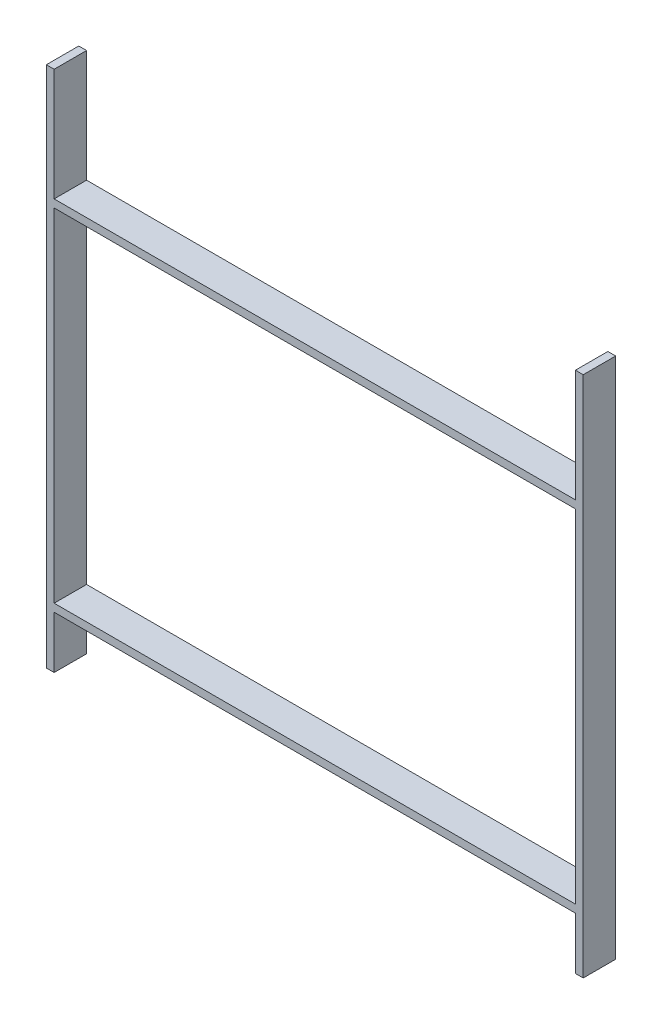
from build123d import *

# Parameters (mm, degrees)
ESQUISSE1_W        = 447
ESQUISSE1_H        = 298
ESQUISSE1_W_2      = 434
ESQUISSE1_H_2      = 285
BOSS_EXTRU_1_DEPTH = 27
ESQUISSE2_W        = 6.5
ESQUISSE2_H        = 100
ESQUISSE2_H_2      = 50
BOSS_EXTRU_2_DEPTH = 27


with BuildPart() as part:
    # Esquisse1 → Boss.-Extru.1 (new body)
    with BuildSketch(Plane.XY):
        Rectangle(ESQUISSE1_W, ESQUISSE1_H)
        Rectangle(ESQUISSE1_W_2, ESQUISSE1_H_2, mode=Mode.SUBTRACT)
    extrude(amount=BOSS_EXTRU_1_DEPTH)

    # Esquisse2 → Boss.-Extru.2 (add)
    with BuildSketch(Plane.XY.offset(27)):
        with Locations((-220.25, 192.5)):
            Rectangle(ESQUISSE2_W, ESQUISSE2_H)
        with Locations((220.25, 192.5)):
            Rectangle(ESQUISSE2_W, ESQUISSE2_H)
        with Locations((220.25, -167.5)):
            Rectangle(ESQUISSE2_W, ESQUISSE2_H_2)
        with Locations((-220.25, -167.5)):
            Rectangle(ESQUISSE2_W, ESQUISSE2_H_2)
    extrude(amount=-BOSS_EXTRU_2_DEPTH)


solid = part.part
